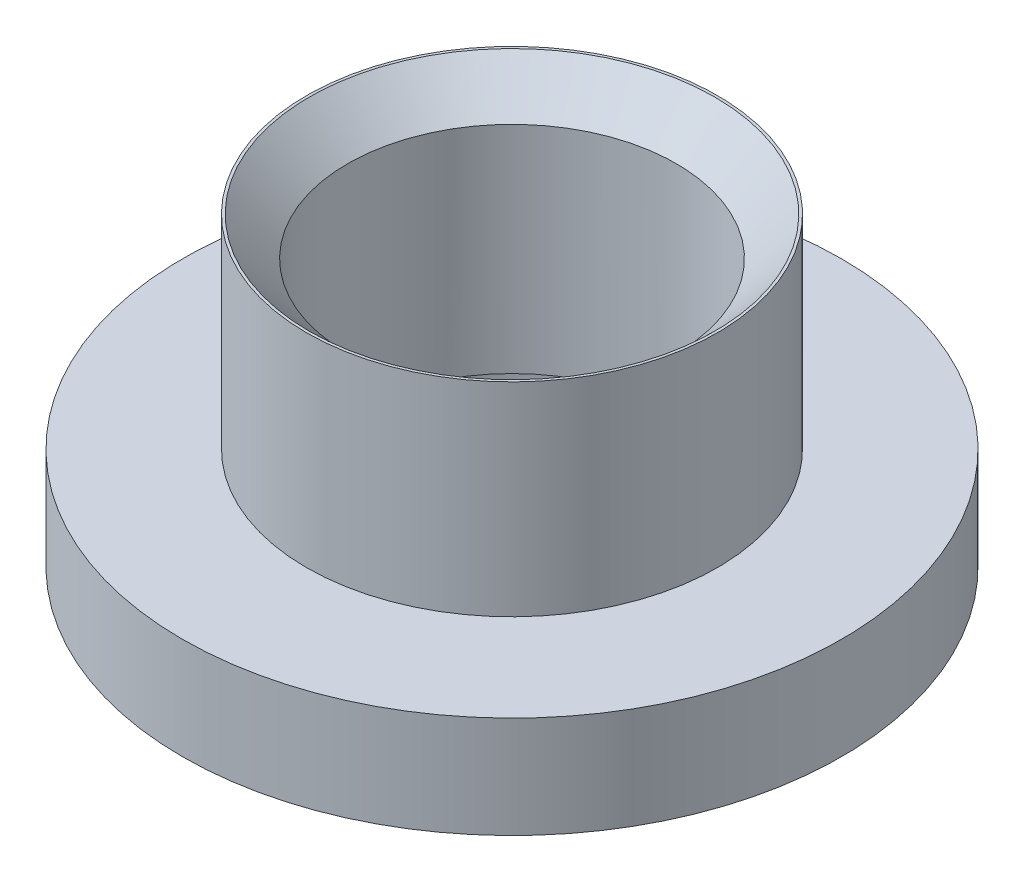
ISO-10303-21;
HEADER;
FILE_DESCRIPTION(('STEP AP214'),'2;1');
FILE_NAME('part.step','',(''),(''),'','','');
FILE_SCHEMA(('AUTOMOTIVE_DESIGN { 1 0 10303 214 1 1 1 1 }'));
ENDSEC;
DATA;
#1=APPLICATION_CONTEXT('core data for automotive mechanical design processes');
#2=APPLICATION_PROTOCOL_DEFINITION('international standard','automotive_design',2000,#1);
#3=PRODUCT_CONTEXT('',#1,'mechanical');
#4=PRODUCT('Part','Part','',(#3));
#5=PRODUCT_RELATED_PRODUCT_CATEGORY('part','',(#4));
#6=PRODUCT_DEFINITION_FORMATION('','',#4);
#7=PRODUCT_DEFINITION_CONTEXT('part definition',#1,'design');
#8=PRODUCT_DEFINITION('design','',#6,#7);
#9=PRODUCT_DEFINITION_SHAPE('','',#8);
#10=(LENGTH_UNIT() NAMED_UNIT(*) SI_UNIT(.MILLI.,.METRE.));
#11=(NAMED_UNIT(*) PLANE_ANGLE_UNIT() SI_UNIT($,.RADIAN.));
#12=(NAMED_UNIT(*) SI_UNIT($,.STERADIAN.) SOLID_ANGLE_UNIT());
#13=UNCERTAINTY_MEASURE_WITH_UNIT(LENGTH_MEASURE(1.E-05),#10,'distance_accuracy_value','');
#14=(GEOMETRIC_REPRESENTATION_CONTEXT(3) GLOBAL_UNCERTAINTY_ASSIGNED_CONTEXT((#13)) GLOBAL_UNIT_ASSIGNED_CONTEXT((#10,
#11,#12)) REPRESENTATION_CONTEXT('',''));
#15=CARTESIAN_POINT('',(0.,0.,0.));
#16=DIRECTION('',(0.,0.,1.));
#17=DIRECTION('',(1.,0.,0.));
#18=AXIS2_PLACEMENT_3D('',#15,#16,#17);
#19=CARTESIAN_POINT('',(0.,0.,0.));
#20=DIRECTION('',(0.,1.,0.));
#21=DIRECTION('',(0.,0.,1.));
#22=AXIS2_PLACEMENT_3D('',#19,#20,#21);
#23=PLANE('',#22);
#24=CARTESIAN_POINT('',(0.,0.,0.));
#25=DIRECTION('',(0.,1.,0.));
#26=DIRECTION('',(0.,0.,1.));
#27=AXIS2_PLACEMENT_3D('',#24,#25,#26);
#28=CIRCLE('',#27,7.68668939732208);
#29=CARTESIAN_POINT('',(0.,0.,7.68668939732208));
#30=VERTEX_POINT('',#29);
#31=EDGE_CURVE('E72',#30,#30,#28,.T.);
#32=ORIENTED_EDGE('',*,*,#31,.F.);
#33=EDGE_LOOP('',(#32));
#34=FACE_BOUND('',#33,.T.);
#35=CARTESIAN_POINT('',(0.,0.,0.));
#36=DIRECTION('',(0.,-1.,0.));
#37=DIRECTION('',(0.,0.,-1.));
#38=AXIS2_PLACEMENT_3D('',#35,#36,#37);
#39=CIRCLE('',#38,6.2992);
#40=CARTESIAN_POINT('',(0.,0.,-6.2992));
#41=VERTEX_POINT('',#40);
#42=EDGE_CURVE('E55',#41,#41,#39,.T.);
#43=ORIENTED_EDGE('',*,*,#42,.F.);
#44=EDGE_LOOP('',(#43));
#45=FACE_BOUND('',#44,.T.);
#46=ADVANCED_FACE('F34',(#34,#45),#23,.F.);
#47=CARTESIAN_POINT('',(0.,9.525,0.));
#48=DIRECTION('',(0.,-1.,0.));
#49=DIRECTION('',(0.,0.,-1.));
#50=AXIS2_PLACEMENT_3D('',#47,#48,#49);
#51=CYLINDRICAL_SURFACE('',#50,10.287);
#52=CARTESIAN_POINT('',(0.,3.175,0.));
#53=DIRECTION('',(0.,-1.,0.));
#54=DIRECTION('',(0.,0.,-1.));
#55=AXIS2_PLACEMENT_3D('',#52,#53,#54);
#56=CIRCLE('',#55,10.287);
#57=CARTESIAN_POINT('',(0.,3.175,-10.287));
#58=VERTEX_POINT('',#57);
#59=EDGE_CURVE('E52',#58,#58,#56,.T.);
#60=ORIENTED_EDGE('',*,*,#59,.T.);
#61=EDGE_LOOP('',(#60));
#62=FACE_BOUND('',#61,.T.);
#63=CARTESIAN_POINT('',(0.,0.,0.));
#64=DIRECTION('',(0.,1.,0.));
#65=DIRECTION('',(0.,0.,1.));
#66=AXIS2_PLACEMENT_3D('',#63,#64,#65);
#67=CIRCLE('',#66,10.287);
#68=CARTESIAN_POINT('',(0.,0.,10.287));
#69=VERTEX_POINT('',#68);
#70=EDGE_CURVE('E45',#69,#69,#67,.T.);
#71=ORIENTED_EDGE('',*,*,#70,.T.);
#72=EDGE_LOOP('',(#71));
#73=FACE_BOUND('',#72,.T.);
#74=ADVANCED_FACE('F105',(#62,#73),#51,.T.);
#75=CARTESIAN_POINT('',(0.,0.,0.));
#76=DIRECTION('',(0.,1.,0.));
#77=DIRECTION('',(0.,0.,1.));
#78=AXIS2_PLACEMENT_3D('',#75,#76,#77);
#79=CIRCLE('',#78,10.0425106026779);
#80=CARTESIAN_POINT('',(0.,0.,10.0425106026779));
#81=VERTEX_POINT('',#80);
#82=EDGE_CURVE('E75',#81,#81,#79,.T.);
#83=ORIENTED_EDGE('',*,*,#82,.T.);
#84=EDGE_LOOP('',(#83));
#85=FACE_BOUND('',#84,.T.);
#86=ORIENTED_EDGE('',*,*,#70,.F.);
#87=EDGE_LOOP('',(#86));
#88=FACE_BOUND('',#87,.T.);
#89=ADVANCED_FACE('F107',(#85,#88),#23,.F.);
#90=CARTESIAN_POINT('',(0.,1.5875,0.));
#91=DIRECTION('',(0.,-1.,0.));
#92=DIRECTION('',(0.,0.,-1.));
#93=AXIS2_PLACEMENT_3D('',#90,#91,#92);
#94=CYLINDRICAL_SURFACE('',#93,6.2992);
#95=CARTESIAN_POINT('',(0.,1.5875,0.));
#96=DIRECTION('',(0.,-1.,0.));
#97=DIRECTION('',(0.,0.,-1.));
#98=AXIS2_PLACEMENT_3D('',#95,#96,#97);
#99=CIRCLE('',#98,6.2992);
#100=CARTESIAN_POINT('',(0.,1.5875,-6.2992));
#101=VERTEX_POINT('',#100);
#102=EDGE_CURVE('E49',#101,#101,#99,.T.);
#103=ORIENTED_EDGE('',*,*,#102,.F.);
#104=EDGE_LOOP('',(#103));
#105=FACE_BOUND('',#104,.T.);
#106=ORIENTED_EDGE('',*,*,#42,.T.);
#107=EDGE_LOOP('',(#106));
#108=FACE_BOUND('',#107,.T.);
#109=ADVANCED_FACE('F110',(#105,#108),#94,.F.);
#110=CARTESIAN_POINT('',(0.,1.5875,0.));
#111=DIRECTION('',(0.,-1.,0.));
#112=DIRECTION('',(0.,0.,-1.));
#113=AXIS2_PLACEMENT_3D('',#110,#111,#112);
#114=PLANE('',#113);
#115=CARTESIAN_POINT('',(0.,1.5875,0.));
#116=DIRECTION('',(0.,-1.,0.));
#117=DIRECTION('',(0.,0.,-1.));
#118=AXIS2_PLACEMENT_3D('',#115,#116,#117);
#119=CIRCLE('',#118,5.1308);
#120=CARTESIAN_POINT('',(0.,1.5875,-5.1308));
#121=VERTEX_POINT('',#120);
#122=EDGE_CURVE('E66',#121,#121,#119,.T.);
#123=ORIENTED_EDGE('',*,*,#122,.F.);
#124=EDGE_LOOP('',(#123));
#125=FACE_BOUND('',#124,.T.);
#126=ORIENTED_EDGE('',*,*,#102,.T.);
#127=EDGE_LOOP('',(#126));
#128=FACE_BOUND('',#127,.T.);
#129=ADVANCED_FACE('F112',(#125,#128),#114,.T.);
#130=CARTESIAN_POINT('',(-16.1818840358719,3.175,0.));
#131=DIRECTION('',(0.,-1.,0.));
#132=DIRECTION('',(0.,0.,-1.));
#133=AXIS2_PLACEMENT_3D('',#130,#131,#132);
#134=PLANE('',#133);
#135=CARTESIAN_POINT('',(0.,3.175,0.));
#136=DIRECTION('',(0.,1.,0.));
#137=DIRECTION('',(0.,0.,1.));
#138=AXIS2_PLACEMENT_3D('',#135,#136,#137);
#139=CIRCLE('',#138,6.4135);
#140=CARTESIAN_POINT('',(0.,3.175,6.4135));
#141=VERTEX_POINT('',#140);
#142=EDGE_CURVE('E58',#141,#141,#139,.T.);
#143=ORIENTED_EDGE('',*,*,#142,.F.);
#144=EDGE_LOOP('',(#143));
#145=FACE_BOUND('',#144,.T.);
#146=ORIENTED_EDGE('',*,*,#59,.F.);
#147=EDGE_LOOP('',(#146));
#148=FACE_BOUND('',#147,.T.);
#149=ADVANCED_FACE('F119',(#145,#148),#134,.F.);
#150=CARTESIAN_POINT('',(0.,0.,0.));
#151=DIRECTION('',(0.,1.,0.));
#152=DIRECTION('',(0.,0.,1.));
#153=AXIS2_PLACEMENT_3D('',#150,#151,#152);
#154=CYLINDRICAL_SURFACE('',#153,6.4135);
#155=CARTESIAN_POINT('',(0.,9.525,0.));
#156=DIRECTION('',(0.,1.,0.));
#157=DIRECTION('',(0.,0.,1.));
#158=AXIS2_PLACEMENT_3D('',#155,#156,#157);
#159=CIRCLE('',#158,6.4135);
#160=CARTESIAN_POINT('',(0.,9.525,6.4135));
#161=VERTEX_POINT('',#160);
#162=EDGE_CURVE('E56',#161,#161,#159,.F.);
#163=ORIENTED_EDGE('',*,*,#162,.T.);
#164=EDGE_LOOP('',(#163));
#165=FACE_BOUND('',#164,.T.);
#166=ORIENTED_EDGE('',*,*,#142,.T.);
#167=EDGE_LOOP('',(#166));
#168=FACE_BOUND('',#167,.T.);
#169=ADVANCED_FACE('F129',(#165,#168),#154,.T.);
#170=CARTESIAN_POINT('',(0.,9.525,0.));
#171=DIRECTION('',(0.,1.,0.));
#172=DIRECTION('',(0.,0.,1.));
#173=AXIS2_PLACEMENT_3D('',#170,#171,#172);
#174=PLANE('',#173);
#175=CARTESIAN_POINT('',(0.,9.525,0.));
#176=DIRECTION('',(0.,1.,0.));
#177=DIRECTION('',(0.,0.,1.));
#178=AXIS2_PLACEMENT_3D('',#175,#176,#177);
#179=CIRCLE('',#178,6.33095);
#180=CARTESIAN_POINT('',(0.,9.525,6.33095));
#181=VERTEX_POINT('',#180);
#182=EDGE_CURVE('E10',#181,#181,#179,.F.);
#183=ORIENTED_EDGE('',*,*,#182,.T.);
#184=EDGE_LOOP('',(#183));
#185=FACE_BOUND('',#184,.T.);
#186=ORIENTED_EDGE('',*,*,#162,.F.);
#187=EDGE_LOOP('',(#186));
#188=FACE_BOUND('',#187,.T.);
#189=ADVANCED_FACE('F126',(#185,#188),#174,.T.);
#190=CARTESIAN_POINT('',(0.,0.,0.));
#191=DIRECTION('',(0.,1.,0.));
#192=DIRECTION('',(0.,0.,1.));
#193=AXIS2_PLACEMENT_3D('',#190,#191,#192);
#194=CYLINDRICAL_SURFACE('',#193,5.1308);
#195=CARTESIAN_POINT('',(0.,8.32484999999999,0.));
#196=DIRECTION('',(0.,1.,0.));
#197=DIRECTION('',(0.,0.,1.));
#198=AXIS2_PLACEMENT_3D('',#195,#196,#197);
#199=CIRCLE('',#198,5.1308);
#200=CARTESIAN_POINT('',(0.,8.32484999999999,5.1308));
#201=VERTEX_POINT('',#200);
#202=EDGE_CURVE('E41',#201,#201,#199,.T.);
#203=ORIENTED_EDGE('',*,*,#202,.T.);
#204=EDGE_LOOP('',(#203));
#205=FACE_BOUND('',#204,.T.);
#206=ORIENTED_EDGE('',*,*,#122,.T.);
#207=EDGE_LOOP('',(#206));
#208=FACE_BOUND('',#207,.T.);
#209=ADVANCED_FACE('F128',(#205,#208),#194,.F.);
#210=CARTESIAN_POINT('',(0.,8.32484999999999,0.));
#211=DIRECTION('',(0.,1.,0.));
#212=DIRECTION('',(0.,0.,1.));
#213=AXIS2_PLACEMENT_3D('',#210,#211,#212);
#214=CONICAL_SURFACE('',#213,5.1308,0.785398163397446);
#215=CARTESIAN_POINT('',(0.,9.525,6.33095));
#216=CARTESIAN_POINT('',(0.,9.5124984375,6.3184484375));
#217=CARTESIAN_POINT('',(0.,9.499996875,6.305946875));
#218=CARTESIAN_POINT('',(0.,9.47499375,6.28094375));
#219=CARTESIAN_POINT('',(0.,9.4624921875,6.2684421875));
#220=CARTESIAN_POINT('',(0.,9.4374890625,6.2434390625));
#221=CARTESIAN_POINT('',(0.,9.4249875,6.2309375));
#222=CARTESIAN_POINT('',(0.,9.399984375,6.205934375));
#223=CARTESIAN_POINT('',(0.,9.3874828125,6.1934328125));
#224=CARTESIAN_POINT('',(0.,9.3624796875,6.1684296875));
#225=CARTESIAN_POINT('',(0.,9.349978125,6.155928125));
#226=CARTESIAN_POINT('',(0.,9.324975,6.130925));
#227=CARTESIAN_POINT('',(0.,9.3124734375,6.1184234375));
#228=CARTESIAN_POINT('',(0.,9.2874703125,6.0934203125));
#229=CARTESIAN_POINT('',(0.,9.27496875,6.08091875));
#230=CARTESIAN_POINT('',(0.,9.249965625,6.055915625));
#231=CARTESIAN_POINT('',(0.,9.2374640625,6.0434140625));
#232=CARTESIAN_POINT('',(0.,9.2124609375,6.0184109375));
#233=CARTESIAN_POINT('',(0.,9.199959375,6.005909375));
#234=CARTESIAN_POINT('',(0.,9.17495625,5.98090625));
#235=CARTESIAN_POINT('',(0.,9.1624546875,5.9684046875));
#236=CARTESIAN_POINT('',(0.,9.1374515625,5.9434015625));
#237=CARTESIAN_POINT('',(0.,9.12495,5.9309));
#238=CARTESIAN_POINT('',(0.,9.099946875,5.905896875));
#239=CARTESIAN_POINT('',(0.,9.0874453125,5.8933953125));
#240=CARTESIAN_POINT('',(0.,9.0624421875,5.8683921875));
#241=CARTESIAN_POINT('',(0.,9.049940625,5.855890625));
#242=CARTESIAN_POINT('',(0.,9.0249375,5.8308875));
#243=CARTESIAN_POINT('',(0.,9.0124359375,5.8183859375));
#244=CARTESIAN_POINT('',(0.,8.9874328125,5.7933828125));
#245=CARTESIAN_POINT('',(0.,8.97493125,5.78088125));
#246=CARTESIAN_POINT('',(0.,8.949928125,5.755878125));
#247=CARTESIAN_POINT('',(0.,8.9374265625,5.7433765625));
#248=CARTESIAN_POINT('',(0.,8.9124234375,5.7183734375));
#249=CARTESIAN_POINT('',(0.,8.899921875,5.705871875));
#250=CARTESIAN_POINT('',(0.,8.87491875,5.68086875));
#251=CARTESIAN_POINT('',(0.,8.86241718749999,5.6683671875));
#252=CARTESIAN_POINT('',(0.,8.8374140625,5.6433640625));
#253=CARTESIAN_POINT('',(0.,8.82491249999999,5.6308625));
#254=CARTESIAN_POINT('',(0.,8.799909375,5.605859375));
#255=CARTESIAN_POINT('',(0.,8.78740781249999,5.5933578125));
#256=CARTESIAN_POINT('',(0.,8.7624046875,5.5683546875));
#257=CARTESIAN_POINT('',(0.,8.74990312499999,5.555853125));
#258=CARTESIAN_POINT('',(0.,8.7249,5.53085));
#259=CARTESIAN_POINT('',(0.,8.71239843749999,5.5183484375));
#260=CARTESIAN_POINT('',(0.,8.68739531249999,5.4933453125));
#261=CARTESIAN_POINT('',(0.,8.67489374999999,5.48084375));
#262=CARTESIAN_POINT('',(0.,8.64989062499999,5.455840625));
#263=CARTESIAN_POINT('',(0.,8.63738906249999,5.4433390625));
#264=CARTESIAN_POINT('',(0.,8.61238593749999,5.4183359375));
#265=CARTESIAN_POINT('',(0.,8.59988437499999,5.405834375));
#266=CARTESIAN_POINT('',(0.,8.57488125,5.38083125));
#267=CARTESIAN_POINT('',(0.,8.56237968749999,5.3683296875));
#268=CARTESIAN_POINT('',(0.,8.5373765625,5.3433265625));
#269=CARTESIAN_POINT('',(0.,8.52487499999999,5.330825));
#270=CARTESIAN_POINT('',(0.,8.49987187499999,5.305821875));
#271=CARTESIAN_POINT('',(0.,8.48737031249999,5.2933203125));
#272=CARTESIAN_POINT('',(0.,8.46236718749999,5.2683171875));
#273=CARTESIAN_POINT('',(0.,8.44986562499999,5.255815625));
#274=CARTESIAN_POINT('',(0.,8.42486249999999,5.2308125));
#275=CARTESIAN_POINT('',(0.,8.41236093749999,5.2183109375));
#276=CARTESIAN_POINT('',(0.,8.38735781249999,5.1933078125));
#277=CARTESIAN_POINT('',(0.,8.37485624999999,5.18080625));
#278=CARTESIAN_POINT('',(0.,8.34985312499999,5.155803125));
#279=CARTESIAN_POINT('',(0.,8.33735156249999,5.1433015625));
#280=CARTESIAN_POINT('',(0.,8.32484999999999,5.1308));
#281=B_SPLINE_CURVE_WITH_KNOTS('',3,(#215,#216,#217,#218,#219,#220,#221,#222,#223,#224,#225,
#226,#227,#228,#229,#230,#231,#232,#233,#234,#235,#236,#237,#238,#239,#240,#241,#242,#243,#244,
#245,#246,#247,#248,#249,#250,#251,#252,#253,#254,#255,#256,#257,#258,#259,#260,#261,#262,#263,
#264,#265,#266,#267,#268,#269,#270,#271,#272,#273,#274,#275,#276,#277,#278,#279,#280),
.UNSPECIFIED.,.F.,.F.,(4,2,2,2,2,2,2,2,2,2,2,2,2,2,2,2,2,2,2,2,2,2,2,2,2,2,2,2,2,2,2,2,4),(0.,
0.0530396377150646,0.106079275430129,0.159118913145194,0.212158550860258,0.265198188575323,
0.318237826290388,0.371277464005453,0.424317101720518,0.477356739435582,0.530396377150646,
0.583436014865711,0.636475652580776,0.689515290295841,0.742554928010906,0.795594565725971,
0.848634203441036,0.901673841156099,0.954713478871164,1.00775311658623,1.06079275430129,
1.11383239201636,1.16687202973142,1.21991166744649,1.27295130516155,1.32599094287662,
1.37903058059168,1.43207021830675,1.48510985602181,1.53814949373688,1.59118913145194,
1.64422876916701,1.69726840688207),.UNSPECIFIED.);
#282=EDGE_CURVE('BSEAM36',#181,#201,#281,.T.);
#283=ORIENTED_EDGE('',*,*,#182,.F.);
#284=ORIENTED_EDGE('',*,*,#202,.F.);
#285=ORIENTED_EDGE('',*,*,#282,.T.);
#286=ORIENTED_EDGE('',*,*,#282,.F.);
#287=EDGE_LOOP('',(#283,#285,#284,#286));
#288=FACE_BOUND('',#287,.T.);
#289=ADVANCED_FACE('F36',(#288),#214,.F.);
#290=CARTESIAN_POINT('',(0.,1.016,0.));
#291=DIRECTION('',(0.,1.,0.));
#292=DIRECTION('',(0.,0.,1.));
#293=AXIS2_PLACEMENT_3D('',#290,#291,#292);
#294=TOROIDAL_SURFACE('',#293,8.03054811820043,0.254000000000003);
#295=CARTESIAN_POINT('',(0.,1.27,0.));
#296=DIRECTION('',(0.,1.,0.));
#297=DIRECTION('',(0.,0.,1.));
#298=AXIS2_PLACEMENT_3D('',#295,#296,#297);
#299=CIRCLE('',#298,8.03054811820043);
#300=CARTESIAN_POINT('',(0.,1.27,8.03054811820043));
#301=VERTEX_POINT('',#300);
#302=EDGE_CURVE('E84',#301,#301,#299,.T.);
#303=ORIENTED_EDGE('',*,*,#302,.F.);
#304=EDGE_LOOP('',(#303));
#305=FACE_BOUND('',#304,.T.);
#306=CARTESIAN_POINT('',(0.,1.03813755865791,0.));
#307=DIRECTION('',(0.,1.,0.));
#308=DIRECTION('',(0.,0.,1.));
#309=AXIS2_PLACEMENT_3D('',#306,#307,#308);
#310=CIRCLE('',#309,7.77751466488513);
#311=CARTESIAN_POINT('',(0.,1.03813755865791,7.77751466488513));
#312=VERTEX_POINT('',#311);
#313=EDGE_CURVE('E69',#312,#312,#310,.T.);
#314=ORIENTED_EDGE('',*,*,#313,.T.);
#315=EDGE_LOOP('',(#314));
#316=FACE_BOUND('',#315,.T.);
#317=ADVANCED_FACE('F90',(#305,#316),#294,.F.);
#318=CARTESIAN_POINT('',(0.,0.,0.));
#319=DIRECTION('',(0.,1.,0.));
#320=DIRECTION('',(0.,0.,1.));
#321=AXIS2_PLACEMENT_3D('',#318,#319,#320);
#322=CONICAL_SURFACE('',#321,7.68668939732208,0.0872664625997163);
#323=ORIENTED_EDGE('',*,*,#313,.F.);
#324=EDGE_LOOP('',(#323));
#325=FACE_BOUND('',#324,.T.);
#326=ORIENTED_EDGE('',*,*,#31,.T.);
#327=EDGE_LOOP('',(#326));
#328=FACE_BOUND('',#327,.T.);
#329=ADVANCED_FACE('F93',(#325,#328),#322,.T.);
#330=CARTESIAN_POINT('',(0.,1.03813755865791,0.));
#331=DIRECTION('',(0.,-1.,0.));
#332=DIRECTION('',(0.,0.,-1.));
#333=AXIS2_PLACEMENT_3D('',#330,#331,#332);
#334=CONICAL_SURFACE('',#333,9.95168533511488,0.0872664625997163);
#335=ORIENTED_EDGE('',*,*,#82,.F.);
#336=EDGE_LOOP('',(#335));
#337=FACE_BOUND('',#336,.T.);
#338=CARTESIAN_POINT('',(0.,1.03813755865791,0.));
#339=DIRECTION('',(0.,1.,0.));
#340=DIRECTION('',(0.,0.,1.));
#341=AXIS2_PLACEMENT_3D('',#338,#339,#340);
#342=CIRCLE('',#341,9.95168533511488);
#343=CARTESIAN_POINT('',(0.,1.03813755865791,9.95168533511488));
#344=VERTEX_POINT('',#343);
#345=EDGE_CURVE('E78',#344,#344,#342,.T.);
#346=ORIENTED_EDGE('',*,*,#345,.T.);
#347=EDGE_LOOP('',(#346));
#348=FACE_BOUND('',#347,.T.);
#349=ADVANCED_FACE('F99',(#337,#348),#334,.F.);
#350=CARTESIAN_POINT('',(0.,1.016,0.));
#351=DIRECTION('',(0.,1.,0.));
#352=DIRECTION('',(0.,0.,1.));
#353=AXIS2_PLACEMENT_3D('',#350,#351,#352);
#354=TOROIDAL_SURFACE('',#353,9.69865188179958,0.254000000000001);
#355=ORIENTED_EDGE('',*,*,#345,.F.);
#356=EDGE_LOOP('',(#355));
#357=FACE_BOUND('',#356,.T.);
#358=CARTESIAN_POINT('',(0.,1.27,0.));
#359=DIRECTION('',(0.,1.,0.));
#360=DIRECTION('',(0.,0.,1.));
#361=AXIS2_PLACEMENT_3D('',#358,#359,#360);
#362=CIRCLE('',#361,9.69865188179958);
#363=CARTESIAN_POINT('',(0.,1.27,9.69865188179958));
#364=VERTEX_POINT('',#363);
#365=EDGE_CURVE('E81',#364,#364,#362,.T.);
#366=ORIENTED_EDGE('',*,*,#365,.T.);
#367=EDGE_LOOP('',(#366));
#368=FACE_BOUND('',#367,.T.);
#369=ADVANCED_FACE('F152',(#357,#368),#354,.F.);
#370=CARTESIAN_POINT('',(0.,1.27,-9.69865188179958));
#371=DIRECTION('',(0.,1.,0.));
#372=DIRECTION('',(0.,0.,1.));
#373=AXIS2_PLACEMENT_3D('',#370,#371,#372);
#374=PLANE('',#373);
#375=ORIENTED_EDGE('',*,*,#365,.F.);
#376=EDGE_LOOP('',(#375));
#377=FACE_BOUND('',#376,.T.);
#378=ORIENTED_EDGE('',*,*,#302,.T.);
#379=EDGE_LOOP('',(#378));
#380=FACE_BOUND('',#379,.T.);
#381=ADVANCED_FACE('F88',(#377,#380),#374,.F.);
#382=CLOSED_SHELL('',(#46,#74,#89,#109,#129,#149,#169,#189,#209,#289,#317,#329,#349,#369,#381));
#383=MANIFOLD_SOLID_BREP('B2',#382);
#384=ADVANCED_BREP_SHAPE_REPRESENTATION('',(#18,#383),#14);
#385=SHAPE_DEFINITION_REPRESENTATION(#9,#384);
ENDSEC;
END-ISO-10303-21;
